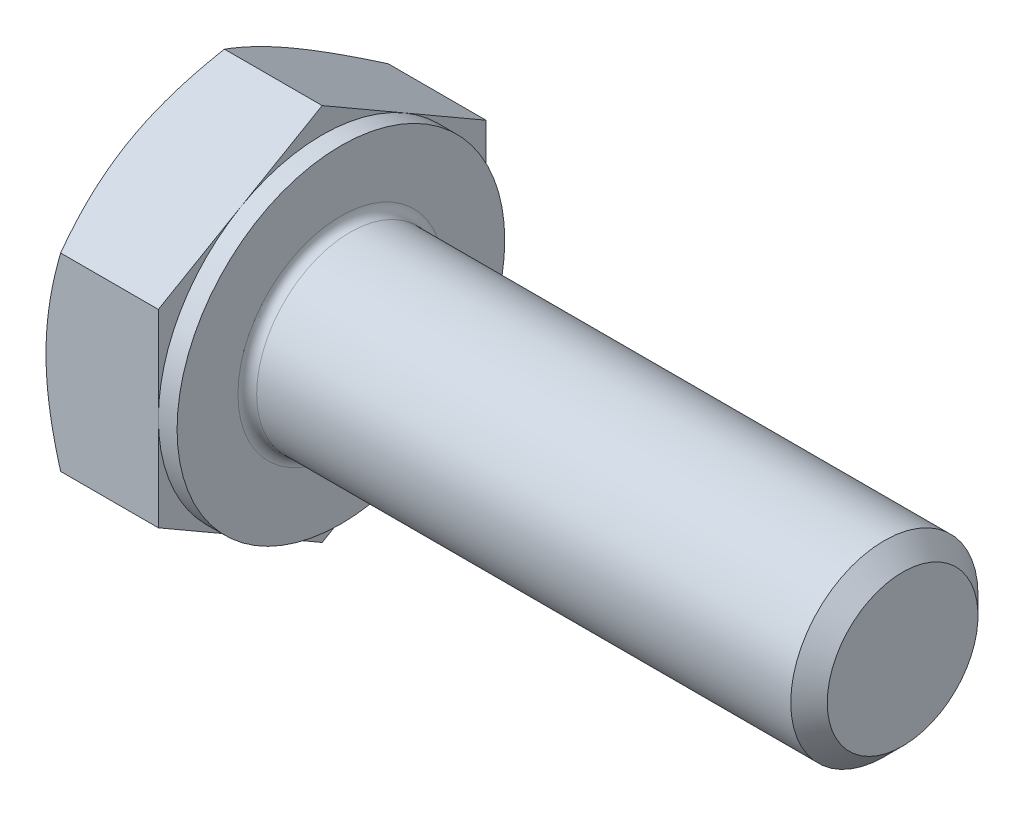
ISO-10303-21;
HEADER;
FILE_DESCRIPTION(('STEP AP214'),'2;1');
FILE_NAME('part.step','',(''),(''),'','','');
FILE_SCHEMA(('AUTOMOTIVE_DESIGN { 1 0 10303 214 1 1 1 1 }'));
ENDSEC;
DATA;
#1=APPLICATION_CONTEXT('core data for automotive mechanical design processes');
#2=APPLICATION_PROTOCOL_DEFINITION('international standard','automotive_design',2000,#1);
#3=PRODUCT_CONTEXT('',#1,'mechanical');
#4=PRODUCT('Part','Part','',(#3));
#5=PRODUCT_RELATED_PRODUCT_CATEGORY('part','',(#4));
#6=PRODUCT_DEFINITION_FORMATION('','',#4);
#7=PRODUCT_DEFINITION_CONTEXT('part definition',#1,'design');
#8=PRODUCT_DEFINITION('design','',#6,#7);
#9=PRODUCT_DEFINITION_SHAPE('','',#8);
#10=(LENGTH_UNIT() NAMED_UNIT(*) SI_UNIT(.MILLI.,.METRE.));
#11=(NAMED_UNIT(*) PLANE_ANGLE_UNIT() SI_UNIT($,.RADIAN.));
#12=(NAMED_UNIT(*) SI_UNIT($,.STERADIAN.) SOLID_ANGLE_UNIT());
#13=UNCERTAINTY_MEASURE_WITH_UNIT(LENGTH_MEASURE(1.E-05),#10,'distance_accuracy_value','');
#14=(GEOMETRIC_REPRESENTATION_CONTEXT(3) GLOBAL_UNCERTAINTY_ASSIGNED_CONTEXT((#13)) GLOBAL_UNIT_ASSIGNED_CONTEXT((#10,
#11,#12)) REPRESENTATION_CONTEXT('',''));
#15=CARTESIAN_POINT('',(0.,0.,0.));
#16=DIRECTION('',(0.,0.,1.));
#17=DIRECTION('',(1.,0.,0.));
#18=AXIS2_PLACEMENT_3D('',#15,#16,#17);
#19=CARTESIAN_POINT('',(2.8,4.04145188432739,0.));
#20=DIRECTION('',(1.,0.,0.));
#21=DIRECTION('',(0.,0.,-1.));
#22=AXIS2_PLACEMENT_3D('',#19,#20,#21);
#23=PLANE('',#22);
#24=CARTESIAN_POINT('',(2.8,0.,0.));
#25=DIRECTION('',(1.,0.,0.));
#26=DIRECTION('',(0.,0.,-1.));
#27=AXIS2_PLACEMENT_3D('',#24,#25,#26);
#28=CIRCLE('',#27,2.2);
#29=CARTESIAN_POINT('',(2.8,0.,-2.2));
#30=VERTEX_POINT('',#29);
#31=EDGE_CURVE('E45',#30,#30,#28,.F.);
#32=ORIENTED_EDGE('',*,*,#31,.T.);
#33=EDGE_LOOP('',(#32));
#34=FACE_BOUND('',#33,.T.);
#35=CARTESIAN_POINT('',(2.8,0.,0.));
#36=DIRECTION('',(1.,0.,0.));
#37=DIRECTION('',(0.,0.,-1.));
#38=AXIS2_PLACEMENT_3D('',#35,#36,#37);
#39=CIRCLE('',#38,3.5);
#40=CARTESIAN_POINT('',(2.8,0.,-3.5));
#41=VERTEX_POINT('',#40);
#42=EDGE_CURVE('E258',#41,#41,#39,.T.);
#43=ORIENTED_EDGE('',*,*,#42,.T.);
#44=EDGE_LOOP('',(#43));
#45=FACE_BOUND('',#44,.T.);
#46=ADVANCED_FACE('F36',(#34,#45),#23,.T.);
#47=CARTESIAN_POINT('',(0.,0.,0.));
#48=DIRECTION('',(-1.,0.,0.));
#49=DIRECTION('',(0.,0.,1.));
#50=AXIS2_PLACEMENT_3D('',#47,#48,#49);
#51=CYLINDRICAL_SURFACE('',#50,2.);
#52=CARTESIAN_POINT('',(3.,0.,0.));
#53=DIRECTION('',(1.,0.,0.));
#54=DIRECTION('',(0.,0.,-1.));
#55=AXIS2_PLACEMENT_3D('',#52,#53,#54);
#56=CIRCLE('',#55,2.);
#57=CARTESIAN_POINT('',(3.,0.,-2.));
#58=VERTEX_POINT('',#57);
#59=EDGE_CURVE('E11',#58,#58,#56,.T.);
#60=ORIENTED_EDGE('',*,*,#59,.T.);
#61=EDGE_LOOP('',(#60));
#62=FACE_BOUND('',#61,.T.);
#63=CARTESIAN_POINT('',(14.41,0.,0.));
#64=DIRECTION('',(-1.,0.,0.));
#65=DIRECTION('',(0.,0.,1.));
#66=AXIS2_PLACEMENT_3D('',#63,#64,#65);
#67=CIRCLE('',#66,2.);
#68=CARTESIAN_POINT('',(14.41,0.,2.));
#69=VERTEX_POINT('',#68);
#70=EDGE_CURVE('E302',#69,#69,#67,.T.);
#71=ORIENTED_EDGE('',*,*,#70,.T.);
#72=EDGE_LOOP('',(#71));
#73=FACE_BOUND('',#72,.T.);
#74=ADVANCED_FACE('F245',(#62,#73),#51,.T.);
#75=CARTESIAN_POINT('',(14.8,0.,0.));
#76=DIRECTION('',(-1.,0.,0.));
#77=DIRECTION('',(0.,0.,1.));
#78=AXIS2_PLACEMENT_3D('',#75,#76,#77);
#79=CONICAL_SURFACE('',#78,1.61,0.785398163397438);
#80=ORIENTED_EDGE('',*,*,#70,.F.);
#81=EDGE_LOOP('',(#80));
#82=FACE_BOUND('',#81,.T.);
#83=CARTESIAN_POINT('',(14.8,0.,0.));
#84=DIRECTION('',(-1.,0.,0.));
#85=DIRECTION('',(0.,0.,1.));
#86=AXIS2_PLACEMENT_3D('',#83,#84,#85);
#87=CIRCLE('',#86,1.61);
#88=CARTESIAN_POINT('',(14.8,0.,1.61));
#89=VERTEX_POINT('',#88);
#90=EDGE_CURVE('E304',#89,#89,#87,.T.);
#91=ORIENTED_EDGE('',*,*,#90,.T.);
#92=EDGE_LOOP('',(#91));
#93=FACE_BOUND('',#92,.T.);
#94=ADVANCED_FACE('F250',(#82,#93),#79,.T.);
#95=CARTESIAN_POINT('',(14.8,0.,0.));
#96=DIRECTION('',(-1.,0.,0.));
#97=DIRECTION('',(0.,0.,1.));
#98=AXIS2_PLACEMENT_3D('',#95,#96,#97);
#99=PLANE('',#98);
#100=ORIENTED_EDGE('',*,*,#90,.F.);
#101=EDGE_LOOP('',(#100));
#102=FACE_BOUND('',#101,.T.);
#103=ADVANCED_FACE('F351',(#102),#99,.F.);
#104=CARTESIAN_POINT('',(2.4,3.5,0.));
#105=DIRECTION('',(1.,0.,0.));
#106=DIRECTION('',(0.,0.,-1.));
#107=AXIS2_PLACEMENT_3D('',#104,#105,#106);
#108=PLANE('',#107);
#109=DIRECTION('',(0.,0.500000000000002,0.866025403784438));
#110=VECTOR('',#109,1.);
#111=CARTESIAN_POINT('',(2.4,2.02072594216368,-3.5));
#112=LINE('',#111,#110);
#113=CARTESIAN_POINT('',(2.4,2.02072594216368,-3.5));
#114=VERTEX_POINT('',#113);
#115=CARTESIAN_POINT('',(2.4,3.03108891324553,-1.75000000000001));
#116=VERTEX_POINT('',#115);
#117=EDGE_CURVE('E169',#114,#116,#112,.T.);
#118=ORIENTED_EDGE('',*,*,#117,.T.);
#119=CARTESIAN_POINT('',(2.4,0.,0.));
#120=DIRECTION('',(-1.,0.,0.));
#121=DIRECTION('',(0.,0.,1.));
#122=AXIS2_PLACEMENT_3D('',#119,#120,#121);
#123=CIRCLE('',#122,3.5);
#124=CARTESIAN_POINT('',(2.4,0.,-3.5));
#125=VERTEX_POINT('',#124);
#126=EDGE_CURVE('E52',#116,#125,#123,.T.);
#127=ORIENTED_EDGE('',*,*,#126,.T.);
#128=DIRECTION('',(0.,1.,0.));
#129=VECTOR('',#128,1.);
#130=CARTESIAN_POINT('',(2.4,2.02072594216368,-3.5));
#131=LINE('',#130,#129);
#132=EDGE_CURVE('E259',#125,#114,#131,.T.);
#133=ORIENTED_EDGE('',*,*,#132,.T.);
#134=EDGE_LOOP('',(#118,#127,#133));
#135=FACE_BOUND('',#134,.T.);
#136=ADVANCED_FACE('F281',(#135),#108,.T.);
#137=CARTESIAN_POINT('',(2.4,4.04145188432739,0.));
#138=VERTEX_POINT('',#137);
#139=EDGE_CURVE('E167',#116,#138,#112,.T.);
#140=ORIENTED_EDGE('',*,*,#139,.T.);
#141=DIRECTION('',(0.,-0.500000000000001,0.866025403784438));
#142=VECTOR('',#141,1.);
#143=CARTESIAN_POINT('',(2.4,4.04145188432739,0.));
#144=LINE('',#143,#142);
#145=CARTESIAN_POINT('',(2.4,3.03108891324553,1.75));
#146=VERTEX_POINT('',#145);
#147=EDGE_CURVE('E166',#138,#146,#144,.T.);
#148=ORIENTED_EDGE('',*,*,#147,.T.);
#149=EDGE_CURVE('E155',#146,#116,#123,.T.);
#150=ORIENTED_EDGE('',*,*,#149,.T.);
#151=EDGE_LOOP('',(#140,#148,#150));
#152=FACE_BOUND('',#151,.T.);
#153=ADVANCED_FACE('F288',(#152),#108,.T.);
#154=CARTESIAN_POINT('',(2.4,2.0207259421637,3.49999999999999));
#155=VERTEX_POINT('',#154);
#156=EDGE_CURVE('E134',#146,#155,#144,.T.);
#157=ORIENTED_EDGE('',*,*,#156,.T.);
#158=DIRECTION('',(0.,-1.,0.));
#159=VECTOR('',#158,1.);
#160=CARTESIAN_POINT('',(2.4,2.0207259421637,3.49999999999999));
#161=LINE('',#160,#159);
#162=CARTESIAN_POINT('',(2.4,0.,3.5));
#163=VERTEX_POINT('',#162);
#164=EDGE_CURVE('E128',#155,#163,#161,.T.);
#165=ORIENTED_EDGE('',*,*,#164,.T.);
#166=EDGE_CURVE('E132',#163,#146,#123,.T.);
#167=ORIENTED_EDGE('',*,*,#166,.T.);
#168=EDGE_LOOP('',(#157,#165,#167));
#169=FACE_BOUND('',#168,.T.);
#170=ADVANCED_FACE('F130',(#169),#108,.T.);
#171=CARTESIAN_POINT('',(2.4,-2.02072594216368,3.5));
#172=VERTEX_POINT('',#171);
#173=EDGE_CURVE('E138',#163,#172,#161,.T.);
#174=ORIENTED_EDGE('',*,*,#173,.T.);
#175=DIRECTION('',(0.,-0.500000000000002,-0.866025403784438));
#176=VECTOR('',#175,1.);
#177=CARTESIAN_POINT('',(2.4,-4.04145188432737,0.));
#178=LINE('',#177,#176);
#179=CARTESIAN_POINT('',(2.4,-3.03108891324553,1.75000000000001));
#180=VERTEX_POINT('',#179);
#181=EDGE_CURVE('E145',#172,#180,#178,.T.);
#182=ORIENTED_EDGE('',*,*,#181,.T.);
#183=EDGE_CURVE('E142',#180,#163,#123,.T.);
#184=ORIENTED_EDGE('',*,*,#183,.T.);
#185=EDGE_LOOP('',(#174,#182,#184));
#186=FACE_BOUND('',#185,.T.);
#187=ADVANCED_FACE('F143',(#186),#108,.T.);
#188=CARTESIAN_POINT('',(2.4,-4.04145188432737,0.));
#189=VERTEX_POINT('',#188);
#190=EDGE_CURVE('E161',#180,#189,#178,.T.);
#191=ORIENTED_EDGE('',*,*,#190,.T.);
#192=DIRECTION('',(0.,0.499999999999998,-0.86602540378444));
#193=VECTOR('',#192,1.);
#194=CARTESIAN_POINT('',(2.4,-2.02072594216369,-3.5));
#195=LINE('',#194,#193);
#196=CARTESIAN_POINT('',(2.4,-3.03108891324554,-1.74999999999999));
#197=VERTEX_POINT('',#196);
#198=EDGE_CURVE('E342',#189,#197,#195,.T.);
#199=ORIENTED_EDGE('',*,*,#198,.T.);
#200=EDGE_CURVE('E149',#197,#180,#123,.T.);
#201=ORIENTED_EDGE('',*,*,#200,.T.);
#202=EDGE_LOOP('',(#191,#199,#201));
#203=FACE_BOUND('',#202,.T.);
#204=ADVANCED_FACE('F343',(#203),#108,.T.);
#205=CARTESIAN_POINT('',(2.4,-2.02072594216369,-3.5));
#206=VERTEX_POINT('',#205);
#207=EDGE_CURVE('E156',#197,#206,#195,.T.);
#208=ORIENTED_EDGE('',*,*,#207,.T.);
#209=EDGE_CURVE('E262',#206,#125,#131,.T.);
#210=ORIENTED_EDGE('',*,*,#209,.T.);
#211=EDGE_CURVE('E274',#125,#197,#123,.T.);
#212=ORIENTED_EDGE('',*,*,#211,.T.);
#213=EDGE_LOOP('',(#208,#210,#212));
#214=FACE_BOUND('',#213,.T.);
#215=ADVANCED_FACE('F273',(#214),#108,.T.);
#216=CARTESIAN_POINT('',(0.,0.,0.));
#217=DIRECTION('',(-1.,0.,0.));
#218=DIRECTION('',(0.,0.,1.));
#219=AXIS2_PLACEMENT_3D('',#216,#217,#218);
#220=CYLINDRICAL_SURFACE('',#219,3.5);
#221=ORIENTED_EDGE('',*,*,#126,.F.);
#222=ORIENTED_EDGE('',*,*,#149,.F.);
#223=ORIENTED_EDGE('',*,*,#166,.F.);
#224=ORIENTED_EDGE('',*,*,#183,.F.);
#225=ORIENTED_EDGE('',*,*,#200,.F.);
#226=ORIENTED_EDGE('',*,*,#211,.F.);
#227=EDGE_LOOP('',(#221,#222,#223,#224,#225,#226));
#228=FACE_BOUND('',#227,.T.);
#229=ORIENTED_EDGE('',*,*,#42,.F.);
#230=EDGE_LOOP('',(#229));
#231=FACE_BOUND('',#230,.T.);
#232=ADVANCED_FACE('F152',(#228,#231),#220,.T.);
#233=CARTESIAN_POINT('',(0.,4.04145188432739,0.));
#234=DIRECTION('',(1.,0.,0.));
#235=DIRECTION('',(0.,0.,-1.));
#236=AXIS2_PLACEMENT_3D('',#233,#234,#235);
#237=PLANE('',#236);
#238=CARTESIAN_POINT('',(0.,0.,0.));
#239=DIRECTION('',(1.,0.,0.));
#240=DIRECTION('',(0.,0.,-1.));
#241=AXIS2_PLACEMENT_3D('',#238,#239,#240);
#242=CIRCLE('',#241,3.5);
#243=CARTESIAN_POINT('',(0.,0.,-3.5));
#244=VERTEX_POINT('',#243);
#245=CARTESIAN_POINT('',(0.,3.03108891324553,-1.75000000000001));
#246=VERTEX_POINT('',#245);
#247=EDGE_CURVE('E260',#244,#246,#242,.T.);
#248=ORIENTED_EDGE('',*,*,#247,.F.);
#249=CARTESIAN_POINT('',(0.,-3.03108891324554,-1.74999999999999));
#250=VERTEX_POINT('',#249);
#251=EDGE_CURVE('E266',#250,#244,#242,.T.);
#252=ORIENTED_EDGE('',*,*,#251,.F.);
#253=CARTESIAN_POINT('',(0.,-3.03108891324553,1.75000000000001));
#254=VERTEX_POINT('',#253);
#255=EDGE_CURVE('E324',#254,#250,#242,.T.);
#256=ORIENTED_EDGE('',*,*,#255,.F.);
#257=CARTESIAN_POINT('',(0.,0.,3.5));
#258=VERTEX_POINT('',#257);
#259=EDGE_CURVE('E320',#258,#254,#242,.T.);
#260=ORIENTED_EDGE('',*,*,#259,.F.);
#261=CARTESIAN_POINT('',(0.,0.,0.));
#262=DIRECTION('',(-1.,0.,0.));
#263=DIRECTION('',(0.,0.,1.));
#264=AXIS2_PLACEMENT_3D('',#261,#262,#263);
#265=CIRCLE('',#264,3.5);
#266=CARTESIAN_POINT('',(0.,3.03108891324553,1.75));
#267=VERTEX_POINT('',#266);
#268=EDGE_CURVE('E170',#258,#267,#265,.T.);
#269=ORIENTED_EDGE('',*,*,#268,.T.);
#270=EDGE_CURVE('E264',#246,#267,#242,.T.);
#271=ORIENTED_EDGE('',*,*,#270,.F.);
#272=EDGE_LOOP('',(#248,#252,#256,#260,#269,#271));
#273=FACE_BOUND('',#272,.T.);
#274=ADVANCED_FACE('F321',(#273),#237,.F.);
#275=CARTESIAN_POINT('',(0.,0.,0.));
#276=DIRECTION('',(1.,0.,0.));
#277=DIRECTION('',(0.,0.,-1.));
#278=AXIS2_PLACEMENT_3D('',#275,#276,#277);
#279=CONICAL_SURFACE('',#278,3.5,1.0471975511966);
#280=CARTESIAN_POINT('',(0.312674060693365,2.02061047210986,3.50019999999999));
#281=CARTESIAN_POINT('',(0.261385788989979,2.10941108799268,3.34639282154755));
#282=CARTESIAN_POINT('',(0.214740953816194,2.1989782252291,3.19125798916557));
#283=CARTESIAN_POINT('',(0.133321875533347,2.37966345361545,2.87830199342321));
#284=CARTESIAN_POINT('',(0.0985764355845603,2.47078475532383,2.7204752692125));
#285=CARTESIAN_POINT('',(0.0444900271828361,2.65189807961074,2.40677778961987));
#286=CARTESIAN_POINT('',(0.0247890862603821,2.741862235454,2.25095530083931));
#287=CARTESIAN_POINT('',(0.00127013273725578,2.92221386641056,1.93857711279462));
#288=CARTESIAN_POINT('',(-0.00256735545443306,3.01260068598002,1.78202254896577));
#289=CARTESIAN_POINT('',(0.0054153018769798,3.1814939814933,1.48949078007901));
#290=CARTESIAN_POINT('',(0.0152754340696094,3.26002573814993,1.35346978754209));
#291=CARTESIAN_POINT('',(0.0465264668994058,3.41657761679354,1.082313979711));
#292=CARTESIAN_POINT('',(0.0679280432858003,3.49459719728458,0.947180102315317));
#293=CARTESIAN_POINT('',(0.121430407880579,3.65147186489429,0.675465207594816));
#294=CARTESIAN_POINT('',(0.153757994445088,3.73030709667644,0.538918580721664));
#295=CARTESIAN_POINT('',(0.227128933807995,3.88680174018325,0.267861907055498));
#296=CARTESIAN_POINT('',(0.268155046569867,3.96446315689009,0.133348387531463));
#297=CARTESIAN_POINT('',(0.312674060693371,4.04156735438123,-0.000199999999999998));
#298=B_SPLINE_CURVE_WITH_KNOTS('',3,(#280,#281,#282,#283,#284,#285,#286,#287,#288,#289,#290,
#291,#292,#293,#294,#295,#296,#297),.UNSPECIFIED.,.F.,.F.,(4,2,2,2,2,2,2,2,4),(0.,
0.554793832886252,1.11092123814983,1.65328467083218,2.19498204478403,2.66665130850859,
3.13875761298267,3.62133612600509,4.10296698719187),.UNSPECIFIED.);
#299=CARTESIAN_POINT('',(0.312607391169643,4.04145188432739,0.));
#300=VERTEX_POINT('',#299);
#301=EDGE_CURVE('E216',#267,#300,#298,.T.);
#302=ORIENTED_EDGE('',*,*,#301,.T.);
#303=CARTESIAN_POINT('',(0.312674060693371,4.04156735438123,0.000199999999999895));
#304=CARTESIAN_POINT('',(0.261385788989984,3.95276673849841,-0.153607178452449));
#305=CARTESIAN_POINT('',(0.214740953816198,3.86319960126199,-0.308742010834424));
#306=CARTESIAN_POINT('',(0.13332187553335,3.68251437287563,-0.621698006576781));
#307=CARTESIAN_POINT('',(0.0985764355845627,3.59139307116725,-0.779524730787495));
#308=CARTESIAN_POINT('',(0.0444900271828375,3.41027974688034,-1.09322221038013));
#309=CARTESIAN_POINT('',(0.0247890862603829,3.32031559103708,-1.24904469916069));
#310=CARTESIAN_POINT('',(0.00127013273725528,3.13996396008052,-1.56142288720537));
#311=CARTESIAN_POINT('',(-0.00256735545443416,3.04957714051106,-1.71797745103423));
#312=CARTESIAN_POINT('',(0.00541530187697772,2.88068384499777,-2.01050921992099));
#313=CARTESIAN_POINT('',(0.0152754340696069,2.80215208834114,-2.1465302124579));
#314=CARTESIAN_POINT('',(0.0465264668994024,2.64560020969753,-2.41768602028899));
#315=CARTESIAN_POINT('',(0.0679280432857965,2.5675806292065,-2.55281989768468));
#316=CARTESIAN_POINT('',(0.121430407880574,2.41070596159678,-2.82453479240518));
#317=CARTESIAN_POINT('',(0.153757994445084,2.33187072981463,-2.96108141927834));
#318=CARTESIAN_POINT('',(0.22712893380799,2.17537608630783,-3.2321380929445));
#319=CARTESIAN_POINT('',(0.268155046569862,2.09771466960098,-3.36665161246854));
#320=CARTESIAN_POINT('',(0.312674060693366,2.02061047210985,-3.5002));
#321=B_SPLINE_CURVE_WITH_KNOTS('',3,(#303,#304,#305,#306,#307,#308,#309,#310,#311,#312,#313,
#314,#315,#316,#317,#318,#319,#320),.UNSPECIFIED.,.F.,.F.,(4,2,2,2,2,2,2,2,4),(0.,
0.554793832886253,1.11092123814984,1.65328467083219,2.19498204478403,2.6666513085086,
3.13875761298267,3.6213361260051,4.10296698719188),.UNSPECIFIED.);
#322=EDGE_CURVE('E60',#300,#246,#321,.T.);
#323=ORIENTED_EDGE('',*,*,#322,.T.);
#324=ORIENTED_EDGE('',*,*,#270,.T.);
#325=EDGE_LOOP('',(#302,#323,#324));
#326=FACE_BOUND('',#325,.T.);
#327=ADVANCED_FACE('F318',(#326),#279,.T.);
#328=CARTESIAN_POINT('',(1.7487697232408,-5.51155991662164,3.5));
#329=CARTESIAN_POINT('',(1.67392336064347,-5.3579514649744,3.5));
#330=CARTESIAN_POINT('',(1.59977092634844,-5.20399921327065,3.5));
#331=CARTESIAN_POINT('',(1.45324265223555,-4.89522455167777,3.5));
#332=CARTESIAN_POINT('',(1.38086707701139,-4.74040201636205,3.5));
#333=CARTESIAN_POINT('',(1.23793493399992,-4.42894615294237,3.5));
#334=CARTESIAN_POINT('',(1.16738971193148,-4.2723076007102,3.5));
#335=CARTESIAN_POINT('',(1.02907715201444,-3.95781335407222,3.5));
#336=CARTESIAN_POINT('',(0.961309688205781,-3.79995771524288,3.5));
#337=CARTESIAN_POINT('',(0.827049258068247,-3.47741113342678,3.5));
#338=CARTESIAN_POINT('',(0.760677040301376,-3.31266966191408,3.5));
#339=CARTESIAN_POINT('',(0.632756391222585,-2.98129055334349,3.5));
#340=CARTESIAN_POINT('',(0.571208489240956,-2.81465271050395,3.5));
#341=CARTESIAN_POINT('',(0.454490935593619,-2.47950135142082,3.5));
#342=CARTESIAN_POINT('',(0.399309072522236,-2.31099212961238,3.5));
#343=CARTESIAN_POINT('',(0.297038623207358,-1.97155788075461,3.5));
#344=CARTESIAN_POINT('',(0.249947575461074,-1.80063360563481,3.5));
#345=CARTESIAN_POINT('',(0.166312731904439,-1.45721769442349,3.5));
#346=CARTESIAN_POINT('',(0.129709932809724,-1.2847406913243,3.5));
#347=CARTESIAN_POINT('',(0.0690664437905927,-0.937557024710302,3.5));
#348=CARTESIAN_POINT('',(0.0450243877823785,-0.762850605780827,3.5));
#349=CARTESIAN_POINT('',(0.0117307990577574,-0.414396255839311,3.5));
#350=CARTESIAN_POINT('',(0.0022826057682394,-0.240667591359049,3.5));
#351=CARTESIAN_POINT('',(-0.00154556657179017,0.106974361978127,3.5));
#352=CARTESIAN_POINT('',(0.00407467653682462,0.280887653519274,3.5));
#353=CARTESIAN_POINT('',(0.025816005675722,0.573677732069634,3.5));
#354=CARTESIAN_POINT('',(0.0381294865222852,0.692856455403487,3.49999999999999));
#355=CARTESIAN_POINT('',(0.0691104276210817,0.930390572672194,3.49999999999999));
#356=CARTESIAN_POINT('',(0.0877786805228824,1.0487458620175,3.49999999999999));
#357=CARTESIAN_POINT('',(0.152339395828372,1.40238821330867,3.49999999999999));
#358=CARTESIAN_POINT('',(0.206777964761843,1.63613518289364,3.49999999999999));
#359=CARTESIAN_POINT('',(0.301818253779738,1.98584040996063,3.49999999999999));
#360=CARTESIAN_POINT('',(0.336200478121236,2.10359260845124,3.49999999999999));
#361=CARTESIAN_POINT('',(0.408694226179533,2.33795453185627,3.49999999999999));
#362=CARTESIAN_POINT('',(0.446805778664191,2.45456424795,3.49999999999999));
#363=CARTESIAN_POINT('',(0.526133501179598,2.68667648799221,3.49999999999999));
#364=CARTESIAN_POINT('',(0.567348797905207,2.80217931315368,3.49999999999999));
#365=CARTESIAN_POINT('',(0.652383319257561,3.03221622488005,3.49999999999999));
#366=CARTESIAN_POINT('',(0.696202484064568,3.14675033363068,3.49999999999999));
#367=CARTESIAN_POINT('',(0.817586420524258,3.45518824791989,3.49999999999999));
#368=CARTESIAN_POINT('',(0.897216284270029,3.6482785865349,3.49999999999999));
#369=CARTESIAN_POINT('',(1.06116121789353,4.03246734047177,3.49999999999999));
#370=CARTESIAN_POINT('',(1.14547680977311,4.2235655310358,3.49999999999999));
#371=CARTESIAN_POINT('',(1.31768022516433,4.6042208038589,3.49999999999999));
#372=CARTESIAN_POINT('',(1.40556928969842,4.79377732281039,3.49999999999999));
#373=CARTESIAN_POINT('',(1.5840729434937,5.17160543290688,3.49999999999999));
#374=CARTESIAN_POINT('',(1.67468761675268,5.35987698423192,3.49999999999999));
#375=CARTESIAN_POINT('',(1.85818750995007,5.73567568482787,3.49999999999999));
#376=CARTESIAN_POINT('',(1.95107608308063,5.92320119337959,3.49999999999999));
#377=CARTESIAN_POINT('',(2.13854805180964,6.29740401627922,3.49999999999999));
#378=CARTESIAN_POINT('',(2.23313146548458,6.48408132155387,3.49999999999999));
#379=CARTESIAN_POINT('',(2.51886265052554,7.04299370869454,3.49999999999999));
#380=CARTESIAN_POINT('',(2.71203324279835,7.41419418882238,3.49999999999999));
#381=CARTESIAN_POINT('',(3.08131090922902,8.11545297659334,3.49999999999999));
#382=CARTESIAN_POINT('',(3.25705680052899,8.4457024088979,3.49999999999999));
#383=CARTESIAN_POINT('',(3.6106670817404,9.10509095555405,3.49999999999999));
#384=CARTESIAN_POINT('',(3.78853160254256,9.434229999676,3.49999999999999));
#385=CARTESIAN_POINT('',(4.14522643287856,10.0905480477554,3.49999999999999));
#386=CARTESIAN_POINT('',(4.32405147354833,10.4177299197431,3.49999999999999));
#387=CARTESIAN_POINT('',(4.68290305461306,11.0714005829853,3.49999999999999));
#388=CARTESIAN_POINT('',(4.86292949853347,11.3978894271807,3.49999999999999));
#389=CARTESIAN_POINT('',(5.04339321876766,11.7241348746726,3.49999999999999));
#390=B_SPLINE_CURVE_WITH_KNOTS('',3,(#328,#329,#330,#331,#332,#333,#334,#335,#336,#337,#338,
#339,#340,#341,#342,#343,#344,#345,#346,#347,#348,#349,#350,#351,#352,#353,#354,#355,#356,#357,
#358,#359,#360,#361,#362,#363,#364,#365,#366,#367,#368,#369,#370,#371,#372,#373,#374,#375,#376,
#377,#378,#379,#380,#381,#382,#383,#384,#385,#386,#387,#388,#389),.UNSPECIFIED.,.F.,.F.,(4,2,2,
2,2,2,2,2,2,2,2,2,2,2,2,2,2,2,2,2,2,2,2,2,2,2,2,2,2,2,4),(0.,0.512624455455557,1.02532478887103,
1.54067716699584,2.05600615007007,2.58877526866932,3.12160276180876,3.65339055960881,
4.18501628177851,4.71358975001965,5.24210571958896,5.76343550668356,6.2847729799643,
6.64403977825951,7.00335140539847,7.72232402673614,8.09029790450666,8.45827462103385,
8.82614818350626,9.19401329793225,9.82051720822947,10.4470910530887,11.0738843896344,
11.7006970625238,12.3284975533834,12.9563047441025,14.211635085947,15.33392926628,
16.4562931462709,17.574877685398,18.6933734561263),.UNSPECIFIED.);
#391=CARTESIAN_POINT('',(0.312607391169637,2.02072594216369,3.49999999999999));
#392=VERTEX_POINT('',#391);
#393=EDGE_CURVE('E228',#258,#392,#390,.T.);
#394=ORIENTED_EDGE('',*,*,#393,.T.);
#395=EDGE_CURVE('E227',#392,#267,#298,.T.);
#396=ORIENTED_EDGE('',*,*,#395,.T.);
#397=ORIENTED_EDGE('',*,*,#268,.F.);
#398=EDGE_LOOP('',(#394,#396,#397));
#399=FACE_BOUND('',#398,.T.);
#400=ADVANCED_FACE('F315',(#399),#279,.T.);
#401=CARTESIAN_POINT('',(0.312607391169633,-2.02072594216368,3.5));
#402=VERTEX_POINT('',#401);
#403=EDGE_CURVE('E306',#402,#258,#390,.T.);
#404=ORIENTED_EDGE('',*,*,#403,.T.);
#405=ORIENTED_EDGE('',*,*,#259,.T.);
#406=CARTESIAN_POINT('',(0.312674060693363,-4.04156735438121,-0.000200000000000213));
#407=CARTESIAN_POINT('',(0.261385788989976,-3.95276673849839,0.153607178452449));
#408=CARTESIAN_POINT('',(0.21474095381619,-3.86319960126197,0.308742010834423));
#409=CARTESIAN_POINT('',(0.133321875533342,-3.68251437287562,0.621698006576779));
#410=CARTESIAN_POINT('',(0.0985764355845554,-3.59139307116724,0.779524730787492));
#411=CARTESIAN_POINT('',(0.0444900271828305,-3.41027974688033,1.09322221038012));
#412=CARTESIAN_POINT('',(0.0247890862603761,-3.32031559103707,1.24904469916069));
#413=CARTESIAN_POINT('',(0.00127013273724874,-3.13996396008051,1.56142288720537));
#414=CARTESIAN_POINT('',(-0.00256735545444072,-3.04957714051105,1.71797745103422));
#415=CARTESIAN_POINT('',(0.00541530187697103,-2.88068384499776,2.01050921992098));
#416=CARTESIAN_POINT('',(0.0152754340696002,-2.80215208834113,2.1465302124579));
#417=CARTESIAN_POINT('',(0.046526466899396,-2.64560020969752,2.41768602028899));
#418=CARTESIAN_POINT('',(0.0679280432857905,-2.56758062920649,2.55281989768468));
#419=CARTESIAN_POINT('',(0.121430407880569,-2.41070596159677,2.82453479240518));
#420=CARTESIAN_POINT('',(0.153757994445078,-2.33187072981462,2.96108141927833));
#421=CARTESIAN_POINT('',(0.227128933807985,-2.17537608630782,3.2321380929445));
#422=CARTESIAN_POINT('',(0.268155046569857,-2.09771466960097,3.36665161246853));
#423=CARTESIAN_POINT('',(0.312674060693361,-2.02061047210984,3.5002));
#424=B_SPLINE_CURVE_WITH_KNOTS('',3,(#406,#407,#408,#409,#410,#411,#412,#413,#414,#415,#416,
#417,#418,#419,#420,#421,#422,#423),.UNSPECIFIED.,.F.,.F.,(4,2,2,2,2,2,2,2,4),(0.,
0.554793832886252,1.11092123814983,1.65328467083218,2.19498204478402,2.66665130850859,
3.13875761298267,3.62133612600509,4.10296698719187),.UNSPECIFIED.);
#425=EDGE_CURVE('E218',#254,#402,#424,.T.);
#426=ORIENTED_EDGE('',*,*,#425,.T.);
#427=EDGE_LOOP('',(#404,#405,#426));
#428=FACE_BOUND('',#427,.T.);
#429=ADVANCED_FACE('F188',(#428),#279,.T.);
#430=CARTESIAN_POINT('',(0.312607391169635,-4.04145188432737,0.));
#431=VERTEX_POINT('',#430);
#432=EDGE_CURVE('E211',#431,#254,#424,.T.);
#433=ORIENTED_EDGE('',*,*,#432,.T.);
#434=ORIENTED_EDGE('',*,*,#255,.T.);
#435=CARTESIAN_POINT('',(0.312674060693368,-2.02061047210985,-3.5002));
#436=CARTESIAN_POINT('',(0.261385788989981,-2.10941108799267,-3.34639282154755));
#437=CARTESIAN_POINT('',(0.214740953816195,-2.19897822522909,-3.19125798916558));
#438=CARTESIAN_POINT('',(0.133321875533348,-2.37966345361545,-2.87830199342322));
#439=CARTESIAN_POINT('',(0.0985764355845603,-2.47078475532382,-2.72047526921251));
#440=CARTESIAN_POINT('',(0.0444900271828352,-2.65189807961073,-2.40677778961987));
#441=CARTESIAN_POINT('',(0.0247890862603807,-2.74186223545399,-2.25095530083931));
#442=CARTESIAN_POINT('',(0.00127013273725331,-2.92221386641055,-1.93857711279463));
#443=CARTESIAN_POINT('',(-0.00256735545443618,-3.01260068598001,-1.78202254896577));
#444=CARTESIAN_POINT('',(0.00541530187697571,-3.18149398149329,-1.48949078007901));
#445=CARTESIAN_POINT('',(0.0152754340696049,-3.26002573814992,-1.3534697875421));
#446=CARTESIAN_POINT('',(0.0465264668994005,-3.41657761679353,-1.08231397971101));
#447=CARTESIAN_POINT('',(0.0679280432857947,-3.49459719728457,-0.947180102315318));
#448=CARTESIAN_POINT('',(0.121430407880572,-3.65147186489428,-0.675465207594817));
#449=CARTESIAN_POINT('',(0.153757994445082,-3.73030709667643,-0.538918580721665));
#450=CARTESIAN_POINT('',(0.227128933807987,-3.88680174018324,-0.267861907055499));
#451=CARTESIAN_POINT('',(0.268155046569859,-3.96446315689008,-0.133348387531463));
#452=CARTESIAN_POINT('',(0.312674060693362,-4.04156735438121,0.000200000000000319));
#453=B_SPLINE_CURVE_WITH_KNOTS('',3,(#435,#436,#437,#438,#439,#440,#441,#442,#443,#444,#445,
#446,#447,#448,#449,#450,#451,#452),.UNSPECIFIED.,.F.,.F.,(4,2,2,2,2,2,2,2,4),(0.,
0.554793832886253,1.11092123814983,1.65328467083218,2.19498204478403,2.6666513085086,
3.13875761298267,3.62133612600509,4.10296698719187),.UNSPECIFIED.);
#454=EDGE_CURVE('E217',#250,#431,#453,.T.);
#455=ORIENTED_EDGE('',*,*,#454,.T.);
#456=EDGE_LOOP('',(#433,#434,#455));
#457=FACE_BOUND('',#456,.T.);
#458=ADVANCED_FACE('F338',(#457),#279,.T.);
#459=CARTESIAN_POINT('',(0.312607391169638,2.02072594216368,-3.5));
#460=VERTEX_POINT('',#459);
#461=EDGE_CURVE('E219',#246,#460,#321,.T.);
#462=ORIENTED_EDGE('',*,*,#461,.T.);
#463=CARTESIAN_POINT('',(1.74876972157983,-5.51155991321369,-3.5));
#464=CARTESIAN_POINT('',(1.6739233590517,-5.3579514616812,-3.5));
#465=CARTESIAN_POINT('',(1.59977092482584,-5.20399921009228,-3.5));
#466=CARTESIAN_POINT('',(1.45324265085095,-4.89522454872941,-3.5));
#467=CARTESIAN_POINT('',(1.38086707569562,-4.74040201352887,-3.5));
#468=CARTESIAN_POINT('',(1.23793493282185,-4.42894615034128,-3.5));
#469=CARTESIAN_POINT('',(1.16738971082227,-4.27230759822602,-3.5));
#470=CARTESIAN_POINT('',(1.02907715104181,-3.95781335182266,-3.5));
#471=CARTESIAN_POINT('',(0.961309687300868,-3.79995771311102,-3.5));
#472=CARTESIAN_POINT('',(0.82704925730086,-3.47741113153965,-3.5));
#473=CARTESIAN_POINT('',(0.760677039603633,-3.31266966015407,-3.5));
#474=CARTESIAN_POINT('',(0.632756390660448,-2.98129055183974,-3.5));
#475=CARTESIAN_POINT('',(0.571208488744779,-2.81465270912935,-3.5));
#476=CARTESIAN_POINT('',(0.454490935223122,-2.47950135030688,-3.5));
#477=CARTESIAN_POINT('',(0.399309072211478,-2.31099212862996,-3.5));
#478=CARTESIAN_POINT('',(0.297038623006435,-1.97155788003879,-3.5));
#479=CARTESIAN_POINT('',(0.249947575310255,-1.80063360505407,-3.5));
#480=CARTESIAN_POINT('',(0.166312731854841,-1.45721769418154,-3.5));
#481=CARTESIAN_POINT('',(0.129709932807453,-1.28474069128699,-3.5));
#482=CARTESIAN_POINT('',(0.0690664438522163,-0.937557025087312,-3.5));
#483=CARTESIAN_POINT('',(0.0450243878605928,-0.762850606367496,-3.5));
#484=CARTESIAN_POINT('',(0.011730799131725,-0.414396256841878,-3.5));
#485=CARTESIAN_POINT('',(0.00228260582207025,-0.24066759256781,-3.5));
#486=CARTESIAN_POINT('',(-0.0015455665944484,0.106974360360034,-3.5));
#487=CARTESIAN_POINT('',(0.00407467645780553,0.280887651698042,-3.5));
#488=CARTESIAN_POINT('',(0.0258160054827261,0.57367772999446,-3.5));
#489=CARTESIAN_POINT('',(0.0381294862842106,0.692856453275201,-3.5));
#490=CARTESIAN_POINT('',(0.0691104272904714,0.930390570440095,-3.5));
#491=CARTESIAN_POINT('',(0.0877786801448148,1.0487458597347,-3.5));
#492=CARTESIAN_POINT('',(0.15233939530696,1.40238821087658,-3.5));
#493=CARTESIAN_POINT('',(0.206777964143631,1.63613518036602,-3.5));
#494=CARTESIAN_POINT('',(0.301818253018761,1.98584040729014,-3.5));
#495=CARTESIAN_POINT('',(0.336200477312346,2.10359260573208,-3.5));
#496=CARTESIAN_POINT('',(0.408694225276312,2.33795452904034,-3.5));
#497=CARTESIAN_POINT('',(0.446805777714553,2.45456424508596,-3.5));
#498=CARTESIAN_POINT('',(0.526133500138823,2.68667648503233,-3.5));
#499=CARTESIAN_POINT('',(0.567348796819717,2.80217931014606,-3.5));
#500=CARTESIAN_POINT('',(0.652383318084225,3.03221622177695,-3.5));
#501=CARTESIAN_POINT('',(0.696202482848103,3.14675033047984,-3.5));
#502=CARTESIAN_POINT('',(0.817586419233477,3.45518824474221,-3.5));
#503=CARTESIAN_POINT('',(0.897216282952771,3.6482785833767,-3.5));
#504=CARTESIAN_POINT('',(1.06116121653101,4.03246733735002,-3.5));
#505=CARTESIAN_POINT('',(1.14547680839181,4.223565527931,-3.5));
#506=CARTESIAN_POINT('',(1.31768022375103,4.60422080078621,-3.5));
#507=CARTESIAN_POINT('',(1.4055692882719,4.79377731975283,-3.5));
#508=CARTESIAN_POINT('',(1.58407294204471,5.17160542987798,-3.5));
#509=CARTESIAN_POINT('',(1.67468761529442,5.35987698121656,-3.5));
#510=CARTESIAN_POINT('',(1.85818750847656,5.73567568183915,-3.5));
#511=CARTESIAN_POINT('',(1.95107608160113,5.92320119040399,-3.5));
#512=CARTESIAN_POINT('',(2.13854805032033,6.29740401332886,-3.5));
#513=CARTESIAN_POINT('',(2.23313146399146,6.48408131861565,-3.5));
#514=CARTESIAN_POINT('',(2.51886264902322,7.04299370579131,-3.5));
#515=CARTESIAN_POINT('',(2.71203324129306,7.41419418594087,-3.5));
#516=CARTESIAN_POINT('',(3.08131090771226,8.11545297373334,-3.5));
#517=CARTESIAN_POINT('',(3.2570567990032,8.44570240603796,-3.5));
#518=CARTESIAN_POINT('',(3.61066708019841,9.10509095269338,-3.5));
#519=CARTESIAN_POINT('',(3.78853160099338,9.43422999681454,-3.5));
#520=CARTESIAN_POINT('',(4.14522643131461,10.0905480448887,-3.5));
#521=CARTESIAN_POINT('',(4.32405147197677,10.4177299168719,-3.5));
#522=CARTESIAN_POINT('',(4.68290305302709,11.0714005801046,-3.5));
#523=CARTESIAN_POINT('',(4.86292949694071,11.3978894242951,-3.5));
#524=CARTESIAN_POINT('',(5.04339321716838,11.7241348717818,-3.5));
#525=B_SPLINE_CURVE_WITH_KNOTS('',3,(#463,#464,#465,#466,#467,#468,#469,#470,#471,#472,#473,
#474,#475,#476,#477,#478,#479,#480,#481,#482,#483,#484,#485,#486,#487,#488,#489,#490,#491,#492,
#493,#494,#495,#496,#497,#498,#499,#500,#501,#502,#503,#504,#505,#506,#507,#508,#509,#510,#511,
#512,#513,#514,#515,#516,#517,#518,#519,#520,#521,#522,#523,#524),.UNSPECIFIED.,.F.,.F.,(4,2,2,
2,2,2,2,2,2,2,2,2,2,2,2,2,2,2,2,2,2,2,2,2,2,2,2,2,2,2,4),(0.,0.512624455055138,1.02532478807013,
1.54067716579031,2.05600614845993,2.58877526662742,3.12160275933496,3.6533905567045,
4.18501627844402,4.71358974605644,5.24210571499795,5.76343550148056,6.28477297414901,
6.64403977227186,7.00335139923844,7.72232402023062,8.09029789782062,8.4582746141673,
8.82614817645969,9.19401329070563,9.82051720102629,10.4470910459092,11.0738843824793,
11.7006970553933,12.3284975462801,12.9563047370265,14.2116350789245,15.333929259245,
16.4562931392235,17.5748776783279,18.6933734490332),.UNSPECIFIED.);
#526=EDGE_CURVE('E181',#460,#244,#525,.F.);
#527=ORIENTED_EDGE('',*,*,#526,.T.);
#528=ORIENTED_EDGE('',*,*,#247,.T.);
#529=EDGE_LOOP('',(#462,#527,#528));
#530=FACE_BOUND('',#529,.T.);
#531=ADVANCED_FACE('F335',(#530),#279,.T.);
#532=CARTESIAN_POINT('',(0.312607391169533,-2.02072594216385,-3.5));
#533=VERTEX_POINT('',#532);
#534=EDGE_CURVE('E182',#533,#250,#453,.T.);
#535=ORIENTED_EDGE('',*,*,#534,.T.);
#536=ORIENTED_EDGE('',*,*,#251,.T.);
#537=EDGE_CURVE('E173',#244,#533,#525,.F.);
#538=ORIENTED_EDGE('',*,*,#537,.T.);
#539=EDGE_LOOP('',(#535,#536,#538));
#540=FACE_BOUND('',#539,.T.);
#541=ADVANCED_FACE('F197',(#540),#279,.T.);
#542=CARTESIAN_POINT('',(2.8,2.02072594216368,-3.5));
#543=DIRECTION('',(0.,0.,1.));
#544=DIRECTION('',(1.,0.,0.));
#545=AXIS2_PLACEMENT_3D('',#542,#543,#544);
#546=PLANE('',#545);
#547=ORIENTED_EDGE('',*,*,#209,.F.);
#548=DIRECTION('',(-1.,0.,0.));
#549=VECTOR('',#548,1.);
#550=CARTESIAN_POINT('',(2.8,-2.02072594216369,-3.5));
#551=LINE('',#550,#549);
#552=EDGE_CURVE('E299',#206,#533,#551,.T.);
#553=ORIENTED_EDGE('',*,*,#552,.T.);
#554=ORIENTED_EDGE('',*,*,#537,.F.);
#555=ORIENTED_EDGE('',*,*,#526,.F.);
#556=DIRECTION('',(-1.,0.,0.));
#557=VECTOR('',#556,1.);
#558=CARTESIAN_POINT('',(2.8,2.02072594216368,-3.5));
#559=LINE('',#558,#557);
#560=EDGE_CURVE('E279',#114,#460,#559,.T.);
#561=ORIENTED_EDGE('',*,*,#560,.F.);
#562=ORIENTED_EDGE('',*,*,#132,.F.);
#563=EDGE_LOOP('',(#547,#553,#554,#555,#561,#562));
#564=FACE_BOUND('',#563,.T.);
#565=ADVANCED_FACE('F192',(#564),#546,.F.);
#566=CARTESIAN_POINT('',(2.8,-2.02072594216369,-3.5));
#567=DIRECTION('',(0.,0.86602540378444,0.499999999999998));
#568=DIRECTION('',(0.,-0.499999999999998,0.86602540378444));
#569=AXIS2_PLACEMENT_3D('',#566,#567,#568);
#570=PLANE('',#569);
#571=ORIENTED_EDGE('',*,*,#198,.F.);
#572=DIRECTION('',(-1.,0.,0.));
#573=VECTOR('',#572,1.);
#574=CARTESIAN_POINT('',(2.8,-4.04145188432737,0.));
#575=LINE('',#574,#573);
#576=EDGE_CURVE('E295',#189,#431,#575,.T.);
#577=ORIENTED_EDGE('',*,*,#576,.T.);
#578=ORIENTED_EDGE('',*,*,#454,.F.);
#579=ORIENTED_EDGE('',*,*,#534,.F.);
#580=ORIENTED_EDGE('',*,*,#552,.F.);
#581=ORIENTED_EDGE('',*,*,#207,.F.);
#582=EDGE_LOOP('',(#571,#577,#578,#579,#580,#581));
#583=FACE_BOUND('',#582,.T.);
#584=ADVANCED_FACE('F196',(#583),#570,.F.);
#585=CARTESIAN_POINT('',(2.8,-4.04145188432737,0.));
#586=DIRECTION('',(0.,0.866025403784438,-0.500000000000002));
#587=DIRECTION('',(0.,0.500000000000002,0.866025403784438));
#588=AXIS2_PLACEMENT_3D('',#585,#586,#587);
#589=PLANE('',#588);
#590=ORIENTED_EDGE('',*,*,#181,.F.);
#591=DIRECTION('',(-1.,0.,0.));
#592=VECTOR('',#591,1.);
#593=CARTESIAN_POINT('',(2.8,-2.02072594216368,3.5));
#594=LINE('',#593,#592);
#595=EDGE_CURVE('E160',#172,#402,#594,.T.);
#596=ORIENTED_EDGE('',*,*,#595,.T.);
#597=ORIENTED_EDGE('',*,*,#425,.F.);
#598=ORIENTED_EDGE('',*,*,#432,.F.);
#599=ORIENTED_EDGE('',*,*,#576,.F.);
#600=ORIENTED_EDGE('',*,*,#190,.F.);
#601=EDGE_LOOP('',(#590,#596,#597,#598,#599,#600));
#602=FACE_BOUND('',#601,.T.);
#603=ADVANCED_FACE('F203',(#602),#589,.F.);
#604=CARTESIAN_POINT('',(2.8,2.0207259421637,3.49999999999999));
#605=DIRECTION('',(0.,0.,-1.));
#606=DIRECTION('',(0.,1.,0.));
#607=AXIS2_PLACEMENT_3D('',#604,#605,#606);
#608=PLANE('',#607);
#609=ORIENTED_EDGE('',*,*,#164,.F.);
#610=DIRECTION('',(-1.,0.,0.));
#611=VECTOR('',#610,1.);
#612=CARTESIAN_POINT('',(2.8,2.0207259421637,3.49999999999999));
#613=LINE('',#612,#611);
#614=EDGE_CURVE('E291',#155,#392,#613,.T.);
#615=ORIENTED_EDGE('',*,*,#614,.T.);
#616=ORIENTED_EDGE('',*,*,#393,.F.);
#617=ORIENTED_EDGE('',*,*,#403,.F.);
#618=ORIENTED_EDGE('',*,*,#595,.F.);
#619=ORIENTED_EDGE('',*,*,#173,.F.);
#620=EDGE_LOOP('',(#609,#615,#616,#617,#618,#619));
#621=FACE_BOUND('',#620,.T.);
#622=ADVANCED_FACE('F158',(#621),#608,.F.);
#623=CARTESIAN_POINT('',(2.8,4.04145188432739,0.));
#624=DIRECTION('',(0.,-0.866025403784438,-0.500000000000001));
#625=DIRECTION('',(0.,0.500000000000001,-0.866025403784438));
#626=AXIS2_PLACEMENT_3D('',#623,#624,#625);
#627=PLANE('',#626);
#628=ORIENTED_EDGE('',*,*,#147,.F.);
#629=DIRECTION('',(-1.,0.,0.));
#630=VECTOR('',#629,1.);
#631=CARTESIAN_POINT('',(2.8,4.04145188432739,0.));
#632=LINE('',#631,#630);
#633=EDGE_CURVE('E286',#138,#300,#632,.T.);
#634=ORIENTED_EDGE('',*,*,#633,.T.);
#635=ORIENTED_EDGE('',*,*,#301,.F.);
#636=ORIENTED_EDGE('',*,*,#395,.F.);
#637=ORIENTED_EDGE('',*,*,#614,.F.);
#638=ORIENTED_EDGE('',*,*,#156,.F.);
#639=EDGE_LOOP('',(#628,#634,#635,#636,#637,#638));
#640=FACE_BOUND('',#639,.T.);
#641=ADVANCED_FACE('F233',(#640),#627,.F.);
#642=CARTESIAN_POINT('',(2.8,2.02072594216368,-3.5));
#643=DIRECTION('',(0.,-0.866025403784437,0.500000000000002));
#644=DIRECTION('',(0.,-0.500000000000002,-0.866025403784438));
#645=AXIS2_PLACEMENT_3D('',#642,#643,#644);
#646=PLANE('',#645);
#647=ORIENTED_EDGE('',*,*,#117,.F.);
#648=ORIENTED_EDGE('',*,*,#560,.T.);
#649=ORIENTED_EDGE('',*,*,#461,.F.);
#650=ORIENTED_EDGE('',*,*,#322,.F.);
#651=ORIENTED_EDGE('',*,*,#633,.F.);
#652=ORIENTED_EDGE('',*,*,#139,.F.);
#653=EDGE_LOOP('',(#647,#648,#649,#650,#651,#652));
#654=FACE_BOUND('',#653,.T.);
#655=ADVANCED_FACE('F38',(#654),#646,.F.);
#656=CARTESIAN_POINT('',(3.,0.,0.));
#657=DIRECTION('',(1.,0.,0.));
#658=DIRECTION('',(0.,0.,-1.));
#659=AXIS2_PLACEMENT_3D('',#656,#657,#658);
#660=TOROIDAL_SURFACE('',#659,2.2,0.2);
#661=ORIENTED_EDGE('',*,*,#59,.F.);
#662=EDGE_LOOP('',(#661));
#663=FACE_BOUND('',#662,.T.);
#664=ORIENTED_EDGE('',*,*,#31,.F.);
#665=EDGE_LOOP('',(#664));
#666=FACE_BOUND('',#665,.T.);
#667=ADVANCED_FACE('F241',(#663,#666),#660,.F.);
#668=CLOSED_SHELL('',(#46,#74,#94,#103,#136,#153,#170,#187,#204,#215,#232,#274,#327,#400,#429,
#458,#531,#541,#565,#584,#603,#622,#641,#655,#667));
#669=MANIFOLD_SOLID_BREP('B2',#668);
#670=ADVANCED_BREP_SHAPE_REPRESENTATION('',(#18,#669),#14);
#671=SHAPE_DEFINITION_REPRESENTATION(#9,#670);
ENDSEC;
END-ISO-10303-21;
